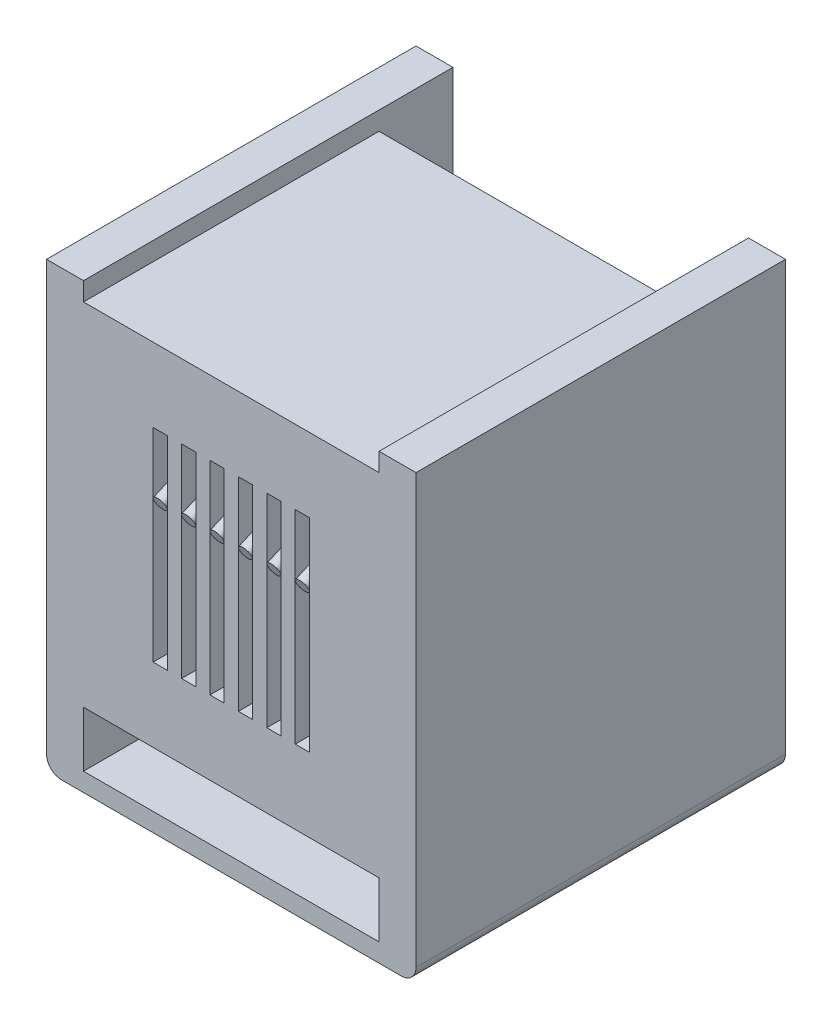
from build123d import *

# Parameters (mm, degrees)
EXTRUDE2_DEPTH     = 12.5
EXTRUDE3_DEPTH     = 10
EXTRUDE4_DEPTH     = 1.875
EXTRUDE5_DEPTH     = 1.25
EXTRUDE6_DEPTH     = 0.625
SKETCH6_W          = 10
SKETCH6_H          = 1.875
CUT_EXTRUDE1_DEPTH = 10
SKETCH7_W          = 0.6
SKETCH7_H          = 0.5
EXTRUDE7_DEPTH     = 1.25
SKETCH8_R          = 0.225384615
FILLET1_R          = 0.5


with BuildPart() as part:
    # Sketch1 → Extrude2 (new body)
    with BuildSketch(Plane.XY):
        Polygon((-6.25, 7.5), (-6.25, -7.5), (6.25, -7.5), (6.25, 7.5), (5, 7.5), (5, -2.5), (5, -5), (3.8, -5), (3.8, -6.875), (0.7, -6.875), (0.7, -5), (-0.5, -5), (-0.5, -2.5), (-5, -2.5), (-5, 7.5), align=None)
    extrude(amount=EXTRUDE2_DEPTH)

    # Sketch2 → Extrude3 (add)
    with BuildSketch(Plane.XY.offset(12.5)):
        Polygon((5, 6.875), (5, 4.375), (3.125, 4.375), (3.125, 6.25), (-3.125, 6.25), (-3.125, 4.375), (-5, 4.375), (-5, 6.875), align=None)
    extrude(amount=-EXTRUDE3_DEPTH)

    # Sketch3 → Extrude4 (add)
    with BuildSketch(Plane.XZ.offset(-6.25)):
        Polygon((3.125, 5), (3.125, 12.5), (-3.125, 12.5), (-3.125, 5), (-2.644230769, 5), (-2.644230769, 9.375), (-2.163461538, 9.375), (-2.163461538, 5), (-1.682692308, 5), (-1.682692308, 9.375), (-1.201923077, 9.375), (-1.201923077, 5), (-0.721153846, 5), (-0.721153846, 9.375), (-0.240384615, 9.375), (-0.240384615, 5), (0.240384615, 5), (0.240384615, 9.375), (0.721153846, 9.375), (0.721153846, 5), (1.201923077, 5), (1.201923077, 9.375), (1.682692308, 9.375), (1.682692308, 5), (2.163461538, 5), (2.163461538, 9.375), (2.644230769, 9.375), (2.644230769, 5), align=None)
    extrude(amount=EXTRUDE4_DEPTH)

    # Sketch4 → Extrude5 (add)
    with BuildSketch(Plane.XY.offset(12.5)):
        Polygon((-5, -5), (5, -5), (5, 4.375), (2.644230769, 4.375), (2.644230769, -2.5), (2.163461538, -2.5), (2.163461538, 4.375), (1.682692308, 4.375), (1.682692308, -2.5), (1.201923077, -2.5), (1.201923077, 4.375), (0.721153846, 4.375), (0.721153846, -2.5), (0.240384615, -2.5), (0.240384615, 4.375), (-0.240384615, 4.375), (-0.240384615, -2.5), (-0.721153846, -2.5), (-0.721153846, 4.375), (-1.201923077, 4.375), (-1.201923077, -2.5), (-1.682692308, -2.5), (-1.682692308, 4.375), (-2.163461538, 4.375), (-2.163461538, -2.5), (-2.644230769, -2.5), (-2.644230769, 4.375), (-5, 4.375), align=None)
    extrude(amount=-EXTRUDE5_DEPTH)

    # Sketch5 → Extrude6 (add)
    with BuildSketch(Plane(origin=(0, 0, 11.25), x_dir=(-1, 0, 0), z_dir=(0, 0, -1))):
        Polygon((3.125, 4.475), (3.125, 0.9375), (2.644230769, 0.9375), (2.644230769, 4.375), (2.163461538, 4.375), (2.163461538, 0.9375), (1.682692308, 0.9375), (1.682692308, 4.375), (1.201923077, 4.375), (1.201923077, 0.9375), (0.721153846, 0.9375), (0.721153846, 4.375), (0.240384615, 4.375), (0.240384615, 0.9375), (-0.240384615, 0.9375), (-0.240384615, 4.375), (-0.721153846, 4.375), (-0.721153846, 0.9375), (-1.201923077, 0.9375), (-1.201923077, 4.375), (-1.682692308, 4.375), (-1.682692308, 0.9375), (-2.163461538, 0.9375), (-2.163461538, 4.375), (-2.644230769, 4.375), (-2.644230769, 0.9375), (-3.125, 0.9375), (-3.125, 4.475), align=None)
    extrude(amount=EXTRUDE6_DEPTH)

    # Sketch6 → Cut-Extrude1 (cut)
    with BuildSketch(Plane.XY.offset(12.5)):
        with Locations((0, -5.9375)):
            Rectangle(SKETCH6_W, SKETCH6_H)
    extrude(amount=-CUT_EXTRUDE1_DEPTH, mode=Mode.SUBTRACT)

    # Sketch7 → Extrude7 (add)
    with BuildSketch(Plane(origin=(0, 0, 11.25), x_dir=(-1, 0, 0), z_dir=(0, 0, -1))):
        with Locations((4.7, -2.25)):
            Rectangle(SKETCH7_W, SKETCH7_H)
    extrude(amount=EXTRUDE7_DEPTH)

    # Sweep1: sweep along a path in Sketch9
    with BuildLine(Plane(origin=(0, 0, 0), x_dir=(0, 0, -1), z_dir=(1, 0, 0))) as sweep1_path:
        Line((-9.375, 6.009615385), (-6.27899362, 6.009615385))
        ThreePointArc((-6.27899362, 6.009615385), (-5.78946961, 5.611430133), (-6.079630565, 5.051080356))
        Line((-6.079630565, 5.051080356), (-12.5, 2.259615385))
    # Sketch8 → Sweep1 (sweep)
    with BuildSketch(Plane(origin=(0, 0, 9.375), x_dir=(-1, 0, 0), z_dir=(0, 0, -1))):
        with Locations((2.403846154, 6.009615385)):
            Circle(SKETCH8_R)
        with Locations((1.442307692, 6.009615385)):
            Circle(SKETCH8_R)
        with Locations((0.480769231, 6.009615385)):
            Circle(SKETCH8_R)
        with Locations((-0.480769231, 6.009615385)):
            Circle(SKETCH8_R)
        with Locations((-1.442307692, 6.009615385)):
            Circle(SKETCH8_R)
        with Locations((-2.403846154, 6.009615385)):
            Circle(SKETCH8_R)
    sweep(path=sweep1_path.line)

    # Fillet1
    fillet1_edges = [part.edges().sort_by_distance(p)[0] for p in [
        (6.25, -7.5, 6.25),
        (-6.25, -7.5, 6.25),
    ]]
    fillet(fillet1_edges, radius=FILLET1_R)


solid = part.part
